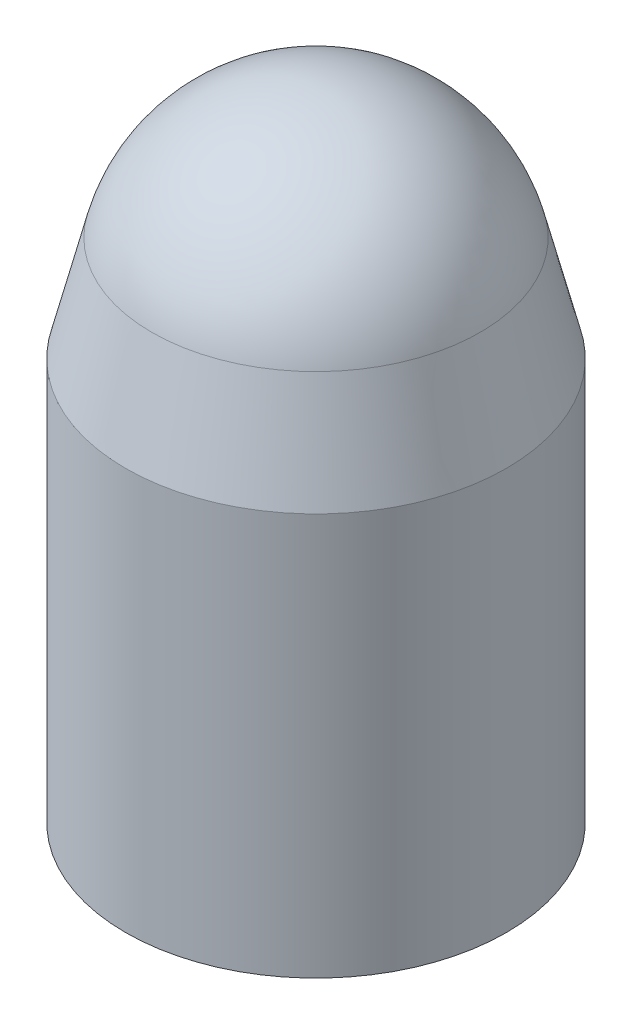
ISO-10303-21;
HEADER;
FILE_DESCRIPTION(('STEP AP214'),'2;1');
FILE_NAME('part.step','',(''),(''),'','','');
FILE_SCHEMA(('AUTOMOTIVE_DESIGN { 1 0 10303 214 1 1 1 1 }'));
ENDSEC;
DATA;
#1=APPLICATION_CONTEXT('core data for automotive mechanical design processes');
#2=APPLICATION_PROTOCOL_DEFINITION('international standard','automotive_design',2000,#1);
#3=PRODUCT_CONTEXT('',#1,'mechanical');
#4=PRODUCT('Part','Part','',(#3));
#5=PRODUCT_RELATED_PRODUCT_CATEGORY('part','',(#4));
#6=PRODUCT_DEFINITION_FORMATION('','',#4);
#7=PRODUCT_DEFINITION_CONTEXT('part definition',#1,'design');
#8=PRODUCT_DEFINITION('design','',#6,#7);
#9=PRODUCT_DEFINITION_SHAPE('','',#8);
#10=(LENGTH_UNIT() NAMED_UNIT(*) SI_UNIT(.MILLI.,.METRE.));
#11=(NAMED_UNIT(*) PLANE_ANGLE_UNIT() SI_UNIT($,.RADIAN.));
#12=(NAMED_UNIT(*) SI_UNIT($,.STERADIAN.) SOLID_ANGLE_UNIT());
#13=UNCERTAINTY_MEASURE_WITH_UNIT(LENGTH_MEASURE(1.E-05),#10,'distance_accuracy_value','');
#14=(GEOMETRIC_REPRESENTATION_CONTEXT(3) GLOBAL_UNCERTAINTY_ASSIGNED_CONTEXT((#13)) GLOBAL_UNIT_ASSIGNED_CONTEXT((#10,
#11,#12)) REPRESENTATION_CONTEXT('',''));
#15=CARTESIAN_POINT('',(0.,0.,0.));
#16=DIRECTION('',(0.,0.,1.));
#17=DIRECTION('',(1.,0.,0.));
#18=AXIS2_PLACEMENT_3D('',#15,#16,#17);
#19=CARTESIAN_POINT('',(0.,60.,0.));
#20=DIRECTION('',(0.,1.,0.));
#21=DIRECTION('',(1.,0.,0.));
#22=AXIS2_PLACEMENT_3D('',#19,#20,#21);
#23=PLANE('',#22);
#24=CARTESIAN_POINT('',(0.,60.,0.));
#25=DIRECTION('',(0.,-1.,0.));
#26=DIRECTION('',(0.,0.,1.));
#27=AXIS2_PLACEMENT_3D('',#24,#25,#26);
#28=CIRCLE('',#27,4.5);
#29=CARTESIAN_POINT('',(0.,60.,4.5));
#30=VERTEX_POINT('',#29);
#31=EDGE_CURVE('E45',#30,#30,#28,.T.);
#32=ORIENTED_EDGE('',*,*,#31,.T.);
#33=EDGE_LOOP('',(#32));
#34=FACE_BOUND('',#33,.T.);
#35=ADVANCED_FACE('F16',(#34),#23,.F.);
#36=CARTESIAN_POINT('',(0.,71.0015344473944,0.));
#37=DIRECTION('',(0.,0.,-1.));
#38=DIRECTION('',(1.,0.,0.));
#39=AXIS2_PLACEMENT_3D('',#36,#37,#38);
#40=SPHERICAL_SURFACE('',#39,4.);
#41=CARTESIAN_POINT('',(0.,71.0015344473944,0.));
#42=DIRECTION('',(0.,1.,0.));
#43=DIRECTION('',(0.,0.,1.));
#44=AXIS2_PLACEMENT_3D('',#41,#42,#43);
#45=SPHERICAL_SURFACE('',#44,4.);
#46=CARTESIAN_POINT('',(0.,71.9744755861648,0.));
#47=DIRECTION('',(0.,1.,0.));
#48=DIRECTION('',(0.,0.,1.));
#49=AXIS2_PLACEMENT_3D('',#46,#47,#48);
#50=CIRCLE('',#49,3.87986926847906);
#51=CARTESIAN_POINT('',(-3.87986926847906,71.9744755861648,0.));
#52=VERTEX_POINT('',#51);
#53=EDGE_CURVE('E11',#52,#52,#50,.T.);
#54=ORIENTED_EDGE('',*,*,#53,.T.);
#55=EDGE_LOOP('',(#54));
#56=FACE_BOUND('',#55,.T.);
#57=ADVANCED_FACE('F64',(#56),#45,.T.);
#58=CARTESIAN_POINT('',(0.,71.9744755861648,0.));
#59=DIRECTION('',(0.,-1.,0.));
#60=DIRECTION('',(0.,0.,-1.));
#61=AXIS2_PLACEMENT_3D('',#58,#59,#60);
#62=CONICAL_SURFACE('',#61,3.87986926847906,0.245699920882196);
#63=CARTESIAN_POINT('',(0.,69.5015344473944,0.));
#64=DIRECTION('',(0.,1.,0.));
#65=DIRECTION('',(0.,0.,1.));
#66=AXIS2_PLACEMENT_3D('',#63,#64,#65);
#67=CIRCLE('',#66,4.5);
#68=CARTESIAN_POINT('',(0.,69.5015344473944,4.5));
#69=VERTEX_POINT('',#68);
#70=EDGE_CURVE('E20',#69,#69,#67,.T.);
#71=ORIENTED_EDGE('',*,*,#70,.T.);
#72=EDGE_LOOP('',(#71));
#73=FACE_BOUND('',#72,.T.);
#74=ORIENTED_EDGE('',*,*,#53,.F.);
#75=EDGE_LOOP('',(#74));
#76=FACE_BOUND('',#75,.T.);
#77=ADVANCED_FACE('F56',(#73,#76),#62,.T.);
#78=CARTESIAN_POINT('',(0.,14.,0.));
#79=DIRECTION('',(0.,1.,0.));
#80=DIRECTION('',(0.,0.,1.));
#81=AXIS2_PLACEMENT_3D('',#78,#79,#80);
#82=CYLINDRICAL_SURFACE('',#81,4.5);
#83=ORIENTED_EDGE('',*,*,#70,.F.);
#84=EDGE_LOOP('',(#83));
#85=FACE_BOUND('',#84,.T.);
#86=ORIENTED_EDGE('',*,*,#31,.F.);
#87=EDGE_LOOP('',(#86));
#88=FACE_BOUND('',#87,.T.);
#89=ADVANCED_FACE('F18',(#85,#88),#82,.T.);
#90=CLOSED_SHELL('',(#35,#57,#77,#89));
#91=MANIFOLD_SOLID_BREP('B1',#90);
#92=ADVANCED_BREP_SHAPE_REPRESENTATION('',(#18,#91),#14);
#93=SHAPE_DEFINITION_REPRESENTATION(#9,#92);
ENDSEC;
END-ISO-10303-21;
